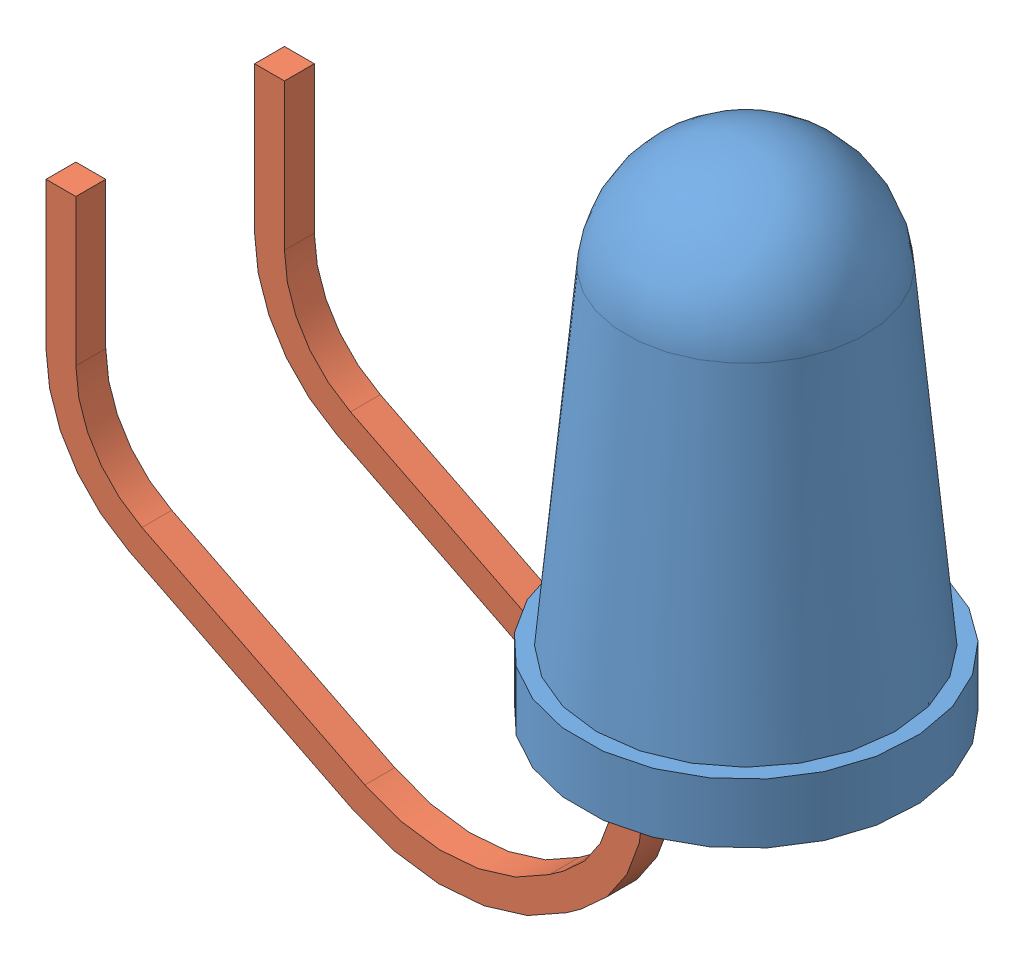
SolidWorks assembly 60D_Led_Blanche.SLDASM, configuration Défaut (file format 3100). Lengths in mm.
Overall size (12.51 11.39 5.5).
3 component instances, 2 part files, 2 mates.
Components (placement in the parent):
- 60D_LedBlanche-1: 60D_LedBlanche.SLDPRT [Défaut] at (0.3275 -2.9616 0) size (5.5 8.32 5.5)
- 60D_Patte_Ledblanche-4: 60D_Patte_Ledblanche.SLDPRT [Défaut] at (0.57 -3.1082 1.7041) size (10 6.93 0.5)
- 60D_Patte_Ledblanche-5: 60D_Patte_Ledblanche.SLDPRT [Défaut] at (0.6402 -3.1082 -1.7165) size (10 6.93 0.5)
Mates (geometry in assembly coordinates):
- Distance1: distance = 2.5 mm anti-aligned: plane of 60D_LedBlanche-1; plane of 60D_Patte_Ledblanche-5
- Distance2: distance = 2.5 mm anti-aligned: plane of 60D_LedBlanche-1; plane of 60D_Patte_Ledblanche-4
